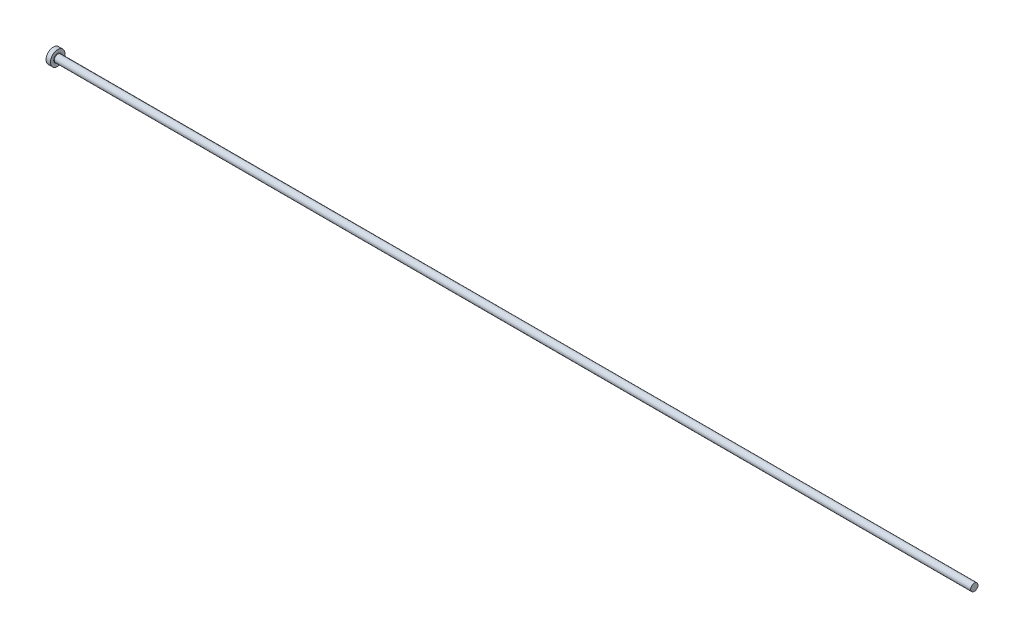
ISO-10303-21;
HEADER;
FILE_DESCRIPTION(('STEP AP214'),'2;1');
FILE_NAME('part.step','',(''),(''),'','','');
FILE_SCHEMA(('AUTOMOTIVE_DESIGN { 1 0 10303 214 1 1 1 1 }'));
ENDSEC;
DATA;
#1=APPLICATION_CONTEXT('core data for automotive mechanical design processes');
#2=APPLICATION_PROTOCOL_DEFINITION('international standard','automotive_design',2000,#1);
#3=PRODUCT_CONTEXT('',#1,'mechanical');
#4=PRODUCT('Part','Part','',(#3));
#5=PRODUCT_RELATED_PRODUCT_CATEGORY('part','',(#4));
#6=PRODUCT_DEFINITION_FORMATION('','',#4);
#7=PRODUCT_DEFINITION_CONTEXT('part definition',#1,'design');
#8=PRODUCT_DEFINITION('design','',#6,#7);
#9=PRODUCT_DEFINITION_SHAPE('','',#8);
#10=(LENGTH_UNIT() NAMED_UNIT(*) SI_UNIT(.MILLI.,.METRE.));
#11=(NAMED_UNIT(*) PLANE_ANGLE_UNIT() SI_UNIT($,.RADIAN.));
#12=(NAMED_UNIT(*) SI_UNIT($,.STERADIAN.) SOLID_ANGLE_UNIT());
#13=UNCERTAINTY_MEASURE_WITH_UNIT(LENGTH_MEASURE(1.E-05),#10,'distance_accuracy_value','');
#14=(GEOMETRIC_REPRESENTATION_CONTEXT(3) GLOBAL_UNCERTAINTY_ASSIGNED_CONTEXT((#13)) GLOBAL_UNIT_ASSIGNED_CONTEXT((#10,
#11,#12)) REPRESENTATION_CONTEXT('',''));
#15=CARTESIAN_POINT('',(0.,0.,0.));
#16=DIRECTION('',(0.,0.,1.));
#17=DIRECTION('',(1.,0.,0.));
#18=AXIS2_PLACEMENT_3D('',#15,#16,#17);
#19=CARTESIAN_POINT('',(0.,0.,0.));
#20=DIRECTION('',(-1.,0.,0.));
#21=DIRECTION('',(0.,-1.,0.));
#22=AXIS2_PLACEMENT_3D('',#19,#20,#21);
#23=PLANE('',#22);
#24=CARTESIAN_POINT('',(0.,0.,0.));
#25=DIRECTION('',(1.,0.,0.));
#26=DIRECTION('',(0.,1.,0.));
#27=AXIS2_PLACEMENT_3D('',#24,#25,#26);
#28=CIRCLE('',#27,5.);
#29=CARTESIAN_POINT('',(0.,5.,0.));
#30=VERTEX_POINT('',#29);
#31=EDGE_CURVE('E25',#30,#30,#28,.T.);
#32=ORIENTED_EDGE('',*,*,#31,.F.);
#33=EDGE_LOOP('',(#32));
#34=FACE_BOUND('',#33,.T.);
#35=ADVANCED_FACE('F14',(#34),#23,.T.);
#36=CARTESIAN_POINT('',(630.,0.,0.));
#37=DIRECTION('',(1.,0.,0.));
#38=DIRECTION('',(0.,1.,0.));
#39=AXIS2_PLACEMENT_3D('',#36,#37,#38);
#40=CYLINDRICAL_SURFACE('',#39,5.);
#41=ORIENTED_EDGE('',*,*,#31,.T.);
#42=EDGE_LOOP('',(#41));
#43=FACE_BOUND('',#42,.T.);
#44=CARTESIAN_POINT('',(3.,0.,0.));
#45=DIRECTION('',(1.,0.,0.));
#46=DIRECTION('',(0.,1.,0.));
#47=AXIS2_PLACEMENT_3D('',#44,#45,#46);
#48=CIRCLE('',#47,5.);
#49=CARTESIAN_POINT('',(3.,5.,0.));
#50=VERTEX_POINT('',#49);
#51=EDGE_CURVE('E29',#50,#50,#48,.T.);
#52=ORIENTED_EDGE('',*,*,#51,.F.);
#53=EDGE_LOOP('',(#52));
#54=FACE_BOUND('',#53,.T.);
#55=ADVANCED_FACE('F51',(#43,#54),#40,.T.);
#56=CARTESIAN_POINT('',(3.,5.,0.));
#57=DIRECTION('',(1.,0.,0.));
#58=DIRECTION('',(0.,1.,0.));
#59=AXIS2_PLACEMENT_3D('',#56,#57,#58);
#60=PLANE('',#59);
#61=CARTESIAN_POINT('',(3.,0.,0.));
#62=DIRECTION('',(1.,0.,0.));
#63=DIRECTION('',(0.,1.,0.));
#64=AXIS2_PLACEMENT_3D('',#61,#62,#63);
#65=CIRCLE('',#64,2.79999999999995);
#66=CARTESIAN_POINT('',(3.,2.79999999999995,0.));
#67=VERTEX_POINT('',#66);
#68=EDGE_CURVE('E9',#67,#67,#65,.F.);
#69=ORIENTED_EDGE('',*,*,#68,.T.);
#70=EDGE_LOOP('',(#69));
#71=FACE_BOUND('',#70,.T.);
#72=ORIENTED_EDGE('',*,*,#51,.T.);
#73=EDGE_LOOP('',(#72));
#74=FACE_BOUND('',#73,.T.);
#75=ADVANCED_FACE('F42',(#71,#74),#60,.T.);
#76=CARTESIAN_POINT('',(630.,0.,0.));
#77=DIRECTION('',(1.,0.,0.));
#78=DIRECTION('',(0.,1.,0.));
#79=AXIS2_PLACEMENT_3D('',#76,#77,#78);
#80=CYLINDRICAL_SURFACE('',#79,2.49999999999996);
#81=CARTESIAN_POINT('',(3.3,0.,0.));
#82=DIRECTION('',(1.,0.,0.));
#83=DIRECTION('',(0.,1.,0.));
#84=AXIS2_PLACEMENT_3D('',#81,#82,#83);
#85=CIRCLE('',#84,2.49999999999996);
#86=CARTESIAN_POINT('',(3.3,2.49999999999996,0.));
#87=VERTEX_POINT('',#86);
#88=EDGE_CURVE('E21',#87,#87,#85,.T.);
#89=ORIENTED_EDGE('',*,*,#88,.T.);
#90=EDGE_LOOP('',(#89));
#91=FACE_BOUND('',#90,.T.);
#92=CARTESIAN_POINT('',(630.,0.,0.));
#93=DIRECTION('',(1.,0.,0.));
#94=DIRECTION('',(0.,1.,0.));
#95=AXIS2_PLACEMENT_3D('',#92,#93,#94);
#96=CIRCLE('',#95,2.49999999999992);
#97=CARTESIAN_POINT('',(630.,2.49999999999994,0.));
#98=VERTEX_POINT('',#97);
#99=EDGE_CURVE('E34',#98,#98,#96,.T.);
#100=ORIENTED_EDGE('',*,*,#99,.F.);
#101=EDGE_LOOP('',(#100));
#102=FACE_BOUND('',#101,.T.);
#103=ADVANCED_FACE('F40',(#91,#102),#80,.T.);
#104=CARTESIAN_POINT('',(630.,2.49999999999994,0.));
#105=DIRECTION('',(1.,0.,0.));
#106=DIRECTION('',(0.,1.,0.));
#107=AXIS2_PLACEMENT_3D('',#104,#105,#106);
#108=PLANE('',#107);
#109=ORIENTED_EDGE('',*,*,#99,.T.);
#110=EDGE_LOOP('',(#109));
#111=FACE_BOUND('',#110,.T.);
#112=ADVANCED_FACE('F38',(#111),#108,.T.);
#113=CARTESIAN_POINT('',(3.3,0.,0.));
#114=DIRECTION('',(1.,0.,0.));
#115=DIRECTION('',(0.,1.,0.));
#116=AXIS2_PLACEMENT_3D('',#113,#114,#115);
#117=TOROIDAL_SURFACE('',#116,2.79999999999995,0.3);
#118=ORIENTED_EDGE('',*,*,#68,.F.);
#119=EDGE_LOOP('',(#118));
#120=FACE_BOUND('',#119,.T.);
#121=ORIENTED_EDGE('',*,*,#88,.F.);
#122=EDGE_LOOP('',(#121));
#123=FACE_BOUND('',#122,.T.);
#124=ADVANCED_FACE('F16',(#120,#123),#117,.F.);
#125=CLOSED_SHELL('',(#35,#55,#75,#103,#112,#124));
#126=MANIFOLD_SOLID_BREP('B1',#125);
#127=ADVANCED_BREP_SHAPE_REPRESENTATION('',(#18,#126),#14);
#128=SHAPE_DEFINITION_REPRESENTATION(#9,#127);
ENDSEC;
END-ISO-10303-21;
